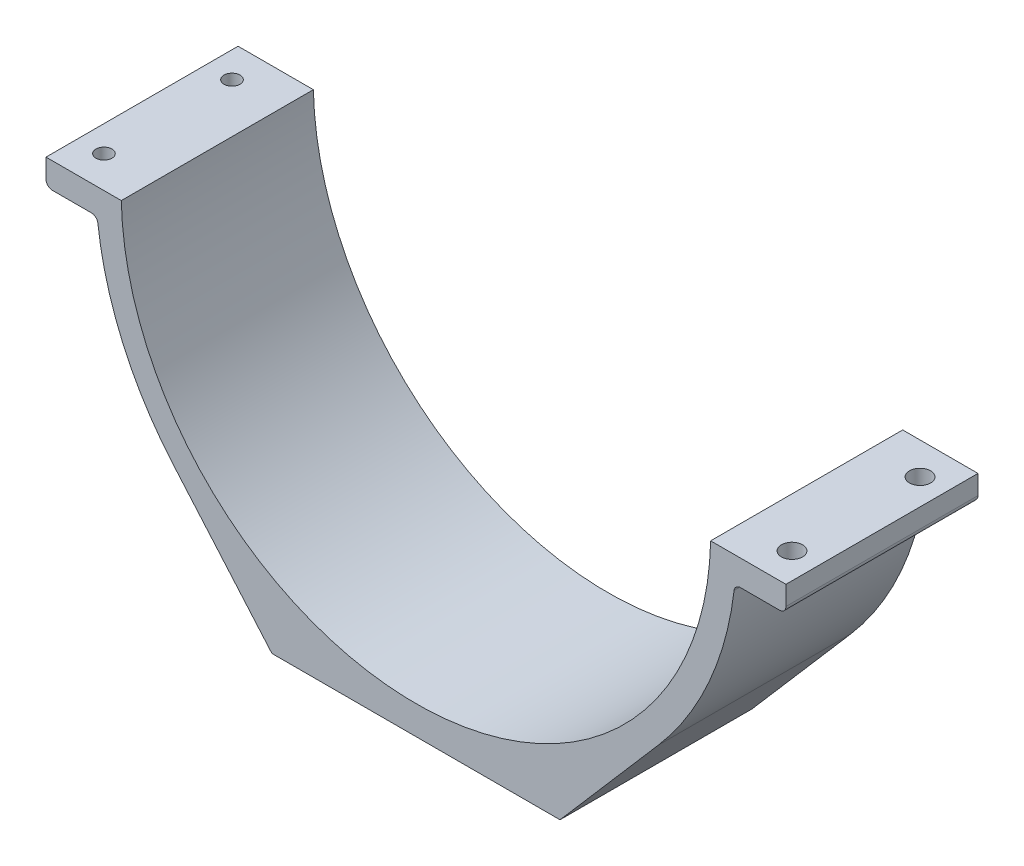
ISO-10303-21;
HEADER;
FILE_DESCRIPTION(('STEP AP214'),'2;1');
FILE_NAME('part.step','',(''),(''),'','','');
FILE_SCHEMA(('AUTOMOTIVE_DESIGN { 1 0 10303 214 1 1 1 1 }'));
ENDSEC;
DATA;
#1=APPLICATION_CONTEXT('core data for automotive mechanical design processes');
#2=APPLICATION_PROTOCOL_DEFINITION('international standard','automotive_design',2000,#1);
#3=PRODUCT_CONTEXT('',#1,'mechanical');
#4=PRODUCT('Part','Part','',(#3));
#5=PRODUCT_RELATED_PRODUCT_CATEGORY('part','',(#4));
#6=PRODUCT_DEFINITION_FORMATION('','',#4);
#7=PRODUCT_DEFINITION_CONTEXT('part definition',#1,'design');
#8=PRODUCT_DEFINITION('design','',#6,#7);
#9=PRODUCT_DEFINITION_SHAPE('','',#8);
#10=(LENGTH_UNIT() NAMED_UNIT(*) SI_UNIT(.MILLI.,.METRE.));
#11=(NAMED_UNIT(*) PLANE_ANGLE_UNIT() SI_UNIT($,.RADIAN.));
#12=(NAMED_UNIT(*) SI_UNIT($,.STERADIAN.) SOLID_ANGLE_UNIT());
#13=UNCERTAINTY_MEASURE_WITH_UNIT(LENGTH_MEASURE(1.E-05),#10,'distance_accuracy_value','');
#14=(GEOMETRIC_REPRESENTATION_CONTEXT(3) GLOBAL_UNCERTAINTY_ASSIGNED_CONTEXT((#13)) GLOBAL_UNIT_ASSIGNED_CONTEXT((#10,
#11,#12)) REPRESENTATION_CONTEXT('',''));
#15=CARTESIAN_POINT('',(0.,0.,0.));
#16=DIRECTION('',(0.,0.,1.));
#17=DIRECTION('',(1.,0.,0.));
#18=AXIS2_PLACEMENT_3D('',#15,#16,#17);
#19=CARTESIAN_POINT('',(-57.7870606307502,-1.,30.));
#20=DIRECTION('',(1.,0.,0.));
#21=DIRECTION('',(0.,1.,0.));
#22=AXIS2_PLACEMENT_3D('',#19,#20,#21);
#23=PLANE('',#22);
#24=DIRECTION('',(0.,-1.,0.));
#25=VECTOR('',#24,1.);
#26=CARTESIAN_POINT('',(-57.7870606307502,-1.,0.));
#27=LINE('',#26,#25);
#28=CARTESIAN_POINT('',(-57.7870606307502,-1.,0.));
#29=VERTEX_POINT('',#28);
#30=CARTESIAN_POINT('',(-57.7870606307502,-4.,0.));
#31=VERTEX_POINT('',#30);
#32=EDGE_CURVE('E183',#29,#31,#27,.T.);
#33=ORIENTED_EDGE('',*,*,#32,.T.);
#34=DIRECTION('',(0.,0.,-1.));
#35=VECTOR('',#34,1.);
#36=CARTESIAN_POINT('',(-57.7870606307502,-4.,30.));
#37=LINE('',#36,#35);
#38=CARTESIAN_POINT('',(-57.7870606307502,-4.,30.));
#39=VERTEX_POINT('',#38);
#40=EDGE_CURVE('E11',#39,#31,#37,.T.);
#41=ORIENTED_EDGE('',*,*,#40,.F.);
#42=DIRECTION('',(0.,-1.,0.));
#43=VECTOR('',#42,1.);
#44=CARTESIAN_POINT('',(-57.7870606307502,-1.,30.));
#45=LINE('',#44,#43);
#46=CARTESIAN_POINT('',(-57.7870606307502,-1.,30.));
#47=VERTEX_POINT('',#46);
#48=EDGE_CURVE('E214',#47,#39,#45,.T.);
#49=ORIENTED_EDGE('',*,*,#48,.F.);
#50=DIRECTION('',(0.,0.,-1.));
#51=VECTOR('',#50,1.);
#52=CARTESIAN_POINT('',(-57.7870606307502,-1.,30.));
#53=LINE('',#52,#51);
#54=EDGE_CURVE('E179',#47,#29,#53,.T.);
#55=ORIENTED_EDGE('',*,*,#54,.T.);
#56=EDGE_LOOP('',(#33,#41,#49,#55));
#57=FACE_BOUND('',#56,.T.);
#58=ADVANCED_FACE('F36',(#57),#23,.F.);
#59=CARTESIAN_POINT('',(-56.7870606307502,-4.,30.));
#60=DIRECTION('',(0.,0.,-1.));
#61=DIRECTION('',(-1.,0.,0.));
#62=AXIS2_PLACEMENT_3D('',#59,#60,#61);
#63=CYLINDRICAL_SURFACE('',#62,1.);
#64=CARTESIAN_POINT('',(-56.7870606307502,-4.,0.));
#65=DIRECTION('',(0.,0.,1.));
#66=DIRECTION('',(1.,0.,0.));
#67=AXIS2_PLACEMENT_3D('',#64,#65,#66);
#68=CIRCLE('',#67,1.);
#69=CARTESIAN_POINT('',(-56.7870606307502,-5.,0.));
#70=VERTEX_POINT('',#69);
#71=EDGE_CURVE('E186',#31,#70,#68,.T.);
#72=ORIENTED_EDGE('',*,*,#71,.T.);
#73=DIRECTION('',(0.,0.,-1.));
#74=VECTOR('',#73,1.);
#75=CARTESIAN_POINT('',(-56.7870606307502,-5.,30.));
#76=LINE('',#75,#74);
#77=CARTESIAN_POINT('',(-56.7870606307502,-5.,30.));
#78=VERTEX_POINT('',#77);
#79=EDGE_CURVE('E44',#78,#70,#76,.T.);
#80=ORIENTED_EDGE('',*,*,#79,.F.);
#81=CARTESIAN_POINT('',(-56.7870606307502,-4.,30.));
#82=DIRECTION('',(0.,0.,1.));
#83=DIRECTION('',(1.,0.,0.));
#84=AXIS2_PLACEMENT_3D('',#81,#82,#83);
#85=CIRCLE('',#84,1.);
#86=EDGE_CURVE('E120',#39,#78,#85,.T.);
#87=ORIENTED_EDGE('',*,*,#86,.F.);
#88=ORIENTED_EDGE('',*,*,#40,.T.);
#89=EDGE_LOOP('',(#72,#80,#87,#88));
#90=FACE_BOUND('',#89,.T.);
#91=ADVANCED_FACE('F315',(#90),#63,.T.);
#92=CARTESIAN_POINT('',(-56.7870606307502,-5.,30.));
#93=DIRECTION('',(0.,1.,0.));
#94=DIRECTION('',(0.,0.,1.));
#95=AXIS2_PLACEMENT_3D('',#92,#93,#94);
#96=PLANE('',#95);
#97=CARTESIAN_POINT('',(-53.7353258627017,-5.,5.));
#98=DIRECTION('',(0.,-1.,0.));
#99=DIRECTION('',(0.,0.,-1.));
#100=AXIS2_PLACEMENT_3D('',#97,#98,#99);
#101=CIRCLE('',#100,1.24999999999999);
#102=CARTESIAN_POINT('',(-53.7353258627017,-5.,3.75000000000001));
#103=VERTEX_POINT('',#102);
#104=EDGE_CURVE('E401',#103,#103,#101,.T.);
#105=ORIENTED_EDGE('',*,*,#104,.F.);
#106=EDGE_LOOP('',(#105));
#107=FACE_BOUND('',#106,.T.);
#108=CARTESIAN_POINT('',(-53.7353258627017,-5.,25.));
#109=DIRECTION('',(0.,-1.,0.));
#110=DIRECTION('',(0.,0.,-1.));
#111=AXIS2_PLACEMENT_3D('',#108,#109,#110);
#112=CIRCLE('',#111,1.24999999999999);
#113=CARTESIAN_POINT('',(-53.7353258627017,-5.,23.75));
#114=VERTEX_POINT('',#113);
#115=EDGE_CURVE('E406',#114,#114,#112,.T.);
#116=ORIENTED_EDGE('',*,*,#115,.F.);
#117=EDGE_LOOP('',(#116));
#118=FACE_BOUND('',#117,.T.);
#119=DIRECTION('',(1.,0.,0.));
#120=VECTOR('',#119,1.);
#121=CARTESIAN_POINT('',(-56.7870606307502,-5.,0.));
#122=LINE('',#121,#120);
#123=CARTESIAN_POINT('',(-50.6835910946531,-5.,0.));
#124=VERTEX_POINT('',#123);
#125=EDGE_CURVE('E189',#70,#124,#122,.T.);
#126=ORIENTED_EDGE('',*,*,#125,.T.);
#127=DIRECTION('',(0.,0.,-1.));
#128=VECTOR('',#127,1.);
#129=CARTESIAN_POINT('',(-50.6835910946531,-5.,30.));
#130=LINE('',#129,#128);
#131=CARTESIAN_POINT('',(-50.6835910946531,-5.,30.));
#132=VERTEX_POINT('',#131);
#133=EDGE_CURVE('E245',#132,#124,#130,.T.);
#134=ORIENTED_EDGE('',*,*,#133,.F.);
#135=DIRECTION('',(1.,0.,0.));
#136=VECTOR('',#135,1.);
#137=CARTESIAN_POINT('',(-56.7870606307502,-5.,30.));
#138=LINE('',#137,#136);
#139=EDGE_CURVE('E253',#78,#132,#138,.T.);
#140=ORIENTED_EDGE('',*,*,#139,.F.);
#141=ORIENTED_EDGE('',*,*,#79,.T.);
#142=EDGE_LOOP('',(#126,#134,#140,#141));
#143=FACE_BOUND('',#142,.T.);
#144=ADVANCED_FACE('F251',(#107,#118,#143),#96,.F.);
#145=CARTESIAN_POINT('',(-50.6835910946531,-6.,30.));
#146=DIRECTION('',(0.,0.,-1.));
#147=DIRECTION('',(-1.,0.,0.));
#148=AXIS2_PLACEMENT_3D('',#145,#146,#147);
#149=CYLINDRICAL_SURFACE('',#148,0.999999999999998);
#150=CARTESIAN_POINT('',(-50.6835910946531,-6.,0.));
#151=DIRECTION('',(0.,0.,-1.));
#152=DIRECTION('',(1.,0.,0.));
#153=AXIS2_PLACEMENT_3D('',#150,#151,#152);
#154=CIRCLE('',#153,0.999999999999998);
#155=CARTESIAN_POINT('',(-49.6905253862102,-5.88243938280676,0.));
#156=VERTEX_POINT('',#155);
#157=EDGE_CURVE('E191',#124,#156,#154,.T.);
#158=ORIENTED_EDGE('',*,*,#157,.T.);
#159=DIRECTION('',(0.,0.,-1.));
#160=VECTOR('',#159,1.);
#161=CARTESIAN_POINT('',(-49.6905253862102,-5.88243938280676,30.));
#162=LINE('',#161,#160);
#163=CARTESIAN_POINT('',(-49.6905253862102,-5.88243938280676,30.));
#164=VERTEX_POINT('',#163);
#165=EDGE_CURVE('E242',#164,#156,#162,.T.);
#166=ORIENTED_EDGE('',*,*,#165,.F.);
#167=CARTESIAN_POINT('',(-50.6835910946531,-6.,30.));
#168=DIRECTION('',(0.,0.,-1.));
#169=DIRECTION('',(1.,0.,0.));
#170=AXIS2_PLACEMENT_3D('',#167,#168,#169);
#171=CIRCLE('',#170,0.999999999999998);
#172=EDGE_CURVE('E271',#132,#164,#171,.T.);
#173=ORIENTED_EDGE('',*,*,#172,.F.);
#174=ORIENTED_EDGE('',*,*,#133,.T.);
#175=EDGE_LOOP('',(#158,#166,#173,#174));
#176=FACE_BOUND('',#175,.T.);
#177=ADVANCED_FACE('F262',(#176),#149,.F.);
#178=CARTESIAN_POINT('',(0.,0.,30.));
#179=DIRECTION('',(0.,0.,-1.));
#180=DIRECTION('',(-1.,0.,0.));
#181=AXIS2_PLACEMENT_3D('',#178,#179,#180);
#182=CYLINDRICAL_SURFACE('',#181,50.0375);
#183=CARTESIAN_POINT('',(0.,0.,0.));
#184=DIRECTION('',(0.,0.,1.));
#185=DIRECTION('',(-1.,0.,0.));
#186=AXIS2_PLACEMENT_3D('',#183,#184,#185);
#187=CIRCLE('',#186,50.0375);
#188=CARTESIAN_POINT('',(-37.8678913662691,-32.7074029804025,0.));
#189=VERTEX_POINT('',#188);
#190=EDGE_CURVE('E193',#156,#189,#187,.T.);
#191=ORIENTED_EDGE('',*,*,#190,.T.);
#192=DIRECTION('',(0.,0.,-1.));
#193=VECTOR('',#192,1.);
#194=CARTESIAN_POINT('',(-37.8678913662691,-32.7074029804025,30.));
#195=LINE('',#194,#193);
#196=CARTESIAN_POINT('',(-37.8678913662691,-32.7074029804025,30.));
#197=VERTEX_POINT('',#196);
#198=EDGE_CURVE('E239',#197,#189,#195,.T.);
#199=ORIENTED_EDGE('',*,*,#198,.F.);
#200=CARTESIAN_POINT('',(0.,0.,30.));
#201=DIRECTION('',(0.,0.,1.));
#202=DIRECTION('',(-1.,0.,0.));
#203=AXIS2_PLACEMENT_3D('',#200,#201,#202);
#204=CIRCLE('',#203,50.0375);
#205=EDGE_CURVE('E268',#164,#197,#204,.T.);
#206=ORIENTED_EDGE('',*,*,#205,.F.);
#207=ORIENTED_EDGE('',*,*,#165,.T.);
#208=EDGE_LOOP('',(#191,#199,#206,#207));
#209=FACE_BOUND('',#208,.T.);
#210=ADVANCED_FACE('F266',(#209),#182,.T.);
#211=CARTESIAN_POINT('',(-37.8678913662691,-32.7074029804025,30.));
#212=DIRECTION('',(0.756790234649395,0.653657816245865,0.));
#213=DIRECTION('',(-0.653657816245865,0.756790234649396,0.));
#214=AXIS2_PLACEMENT_3D('',#211,#212,#213);
#215=PLANE('',#214);
#216=DIRECTION('',(0.653657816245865,-0.756790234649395,0.));
#217=VECTOR('',#216,1.);
#218=CARTESIAN_POINT('',(-37.8678913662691,-32.7074029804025,0.));
#219=LINE('',#218,#217);
#220=CARTESIAN_POINT('',(-22.5,-50.4999999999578,0.));
#221=VERTEX_POINT('',#220);
#222=EDGE_CURVE('E195',#189,#221,#219,.T.);
#223=ORIENTED_EDGE('',*,*,#222,.T.);
#224=DIRECTION('',(0.,0.,-1.));
#225=VECTOR('',#224,1.);
#226=CARTESIAN_POINT('',(-22.5,-50.4999999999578,30.));
#227=LINE('',#226,#225);
#228=CARTESIAN_POINT('',(-22.5,-50.4999999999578,30.));
#229=VERTEX_POINT('',#228);
#230=EDGE_CURVE('E236',#229,#221,#227,.T.);
#231=ORIENTED_EDGE('',*,*,#230,.F.);
#232=DIRECTION('',(0.653657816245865,-0.756790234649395,0.));
#233=VECTOR('',#232,1.);
#234=CARTESIAN_POINT('',(-37.8678913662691,-32.7074029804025,30.));
#235=LINE('',#234,#233);
#236=EDGE_CURVE('E270',#197,#229,#235,.T.);
#237=ORIENTED_EDGE('',*,*,#236,.F.);
#238=ORIENTED_EDGE('',*,*,#198,.T.);
#239=EDGE_LOOP('',(#223,#231,#237,#238));
#240=FACE_BOUND('',#239,.T.);
#241=ADVANCED_FACE('F329',(#240),#215,.F.);
#242=CARTESIAN_POINT('',(22.5,-50.4999999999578,30.));
#243=DIRECTION('',(0.,1.,0.));
#244=DIRECTION('',(-1.,0.,0.));
#245=AXIS2_PLACEMENT_3D('',#242,#243,#244);
#246=PLANE('',#245);
#247=CARTESIAN_POINT('',(-20.,-50.4999999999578,5.));
#248=DIRECTION('',(0.,-1.,0.));
#249=DIRECTION('',(0.,0.,-1.));
#250=AXIS2_PLACEMENT_3D('',#247,#248,#249);
#251=CIRCLE('',#250,1.65);
#252=CARTESIAN_POINT('',(-20.,-50.4999999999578,3.35));
#253=VERTEX_POINT('',#252);
#254=EDGE_CURVE('E369',#253,#253,#251,.T.);
#255=ORIENTED_EDGE('',*,*,#254,.F.);
#256=EDGE_LOOP('',(#255));
#257=FACE_BOUND('',#256,.T.);
#258=CARTESIAN_POINT('',(20.,-50.4999999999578,5.));
#259=DIRECTION('',(0.,-1.,0.));
#260=DIRECTION('',(0.,0.,-1.));
#261=AXIS2_PLACEMENT_3D('',#258,#259,#260);
#262=CIRCLE('',#261,1.65);
#263=CARTESIAN_POINT('',(20.,-50.4999999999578,3.35));
#264=VERTEX_POINT('',#263);
#265=EDGE_CURVE('E383',#264,#264,#262,.T.);
#266=ORIENTED_EDGE('',*,*,#265,.F.);
#267=EDGE_LOOP('',(#266));
#268=FACE_BOUND('',#267,.T.);
#269=CARTESIAN_POINT('',(-20.0000000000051,-50.4999999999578,25.));
#270=DIRECTION('',(0.,-1.,0.));
#271=DIRECTION('',(0.,0.,-1.));
#272=AXIS2_PLACEMENT_3D('',#269,#270,#271);
#273=CIRCLE('',#272,1.65);
#274=CARTESIAN_POINT('',(-20.0000000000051,-50.4999999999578,23.35));
#275=VERTEX_POINT('',#274);
#276=EDGE_CURVE('E389',#275,#275,#273,.T.);
#277=ORIENTED_EDGE('',*,*,#276,.F.);
#278=EDGE_LOOP('',(#277));
#279=FACE_BOUND('',#278,.T.);
#280=CARTESIAN_POINT('',(20.0000000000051,-50.4999999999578,25.));
#281=DIRECTION('',(0.,-1.,0.));
#282=DIRECTION('',(0.,0.,-1.));
#283=AXIS2_PLACEMENT_3D('',#280,#281,#282);
#284=CIRCLE('',#283,1.65);
#285=CARTESIAN_POINT('',(20.0000000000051,-50.4999999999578,23.35));
#286=VERTEX_POINT('',#285);
#287=EDGE_CURVE('E395',#286,#286,#284,.T.);
#288=ORIENTED_EDGE('',*,*,#287,.F.);
#289=EDGE_LOOP('',(#288));
#290=FACE_BOUND('',#289,.T.);
#291=DIRECTION('',(1.,0.,0.));
#292=VECTOR('',#291,1.);
#293=CARTESIAN_POINT('',(22.5,-50.4999999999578,0.));
#294=LINE('',#293,#292);
#295=CARTESIAN_POINT('',(22.5,-50.4999999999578,0.));
#296=VERTEX_POINT('',#295);
#297=EDGE_CURVE('E197',#221,#296,#294,.T.);
#298=ORIENTED_EDGE('',*,*,#297,.T.);
#299=DIRECTION('',(0.,0.,-1.));
#300=VECTOR('',#299,1.);
#301=CARTESIAN_POINT('',(22.5,-50.4999999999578,30.));
#302=LINE('',#301,#300);
#303=CARTESIAN_POINT('',(22.5,-50.4999999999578,30.));
#304=VERTEX_POINT('',#303);
#305=EDGE_CURVE('E233',#304,#296,#302,.T.);
#306=ORIENTED_EDGE('',*,*,#305,.F.);
#307=DIRECTION('',(1.,0.,0.));
#308=VECTOR('',#307,1.);
#309=CARTESIAN_POINT('',(22.5,-50.4999999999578,30.));
#310=LINE('',#309,#308);
#311=EDGE_CURVE('E273',#229,#304,#310,.T.);
#312=ORIENTED_EDGE('',*,*,#311,.F.);
#313=ORIENTED_EDGE('',*,*,#230,.T.);
#314=EDGE_LOOP('',(#298,#306,#312,#313));
#315=FACE_BOUND('',#314,.T.);
#316=ADVANCED_FACE('F332',(#257,#268,#279,#290,#315),#246,.F.);
#317=CARTESIAN_POINT('',(37.8678913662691,-32.7074029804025,30.));
#318=DIRECTION('',(-0.756790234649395,0.653657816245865,0.));
#319=DIRECTION('',(-0.653657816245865,-0.756790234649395,0.));
#320=AXIS2_PLACEMENT_3D('',#317,#318,#319);
#321=PLANE('',#320);
#322=DIRECTION('',(0.653657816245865,0.756790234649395,0.));
#323=VECTOR('',#322,1.);
#324=CARTESIAN_POINT('',(37.8678913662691,-32.7074029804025,0.));
#325=LINE('',#324,#323);
#326=CARTESIAN_POINT('',(37.8678913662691,-32.7074029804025,0.));
#327=VERTEX_POINT('',#326);
#328=EDGE_CURVE('E199',#296,#327,#325,.T.);
#329=ORIENTED_EDGE('',*,*,#328,.T.);
#330=DIRECTION('',(0.,0.,-1.));
#331=VECTOR('',#330,1.);
#332=CARTESIAN_POINT('',(37.8678913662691,-32.7074029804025,30.));
#333=LINE('',#332,#331);
#334=CARTESIAN_POINT('',(37.8678913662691,-32.7074029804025,30.));
#335=VERTEX_POINT('',#334);
#336=EDGE_CURVE('E230',#335,#327,#333,.T.);
#337=ORIENTED_EDGE('',*,*,#336,.F.);
#338=DIRECTION('',(0.653657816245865,0.756790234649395,0.));
#339=VECTOR('',#338,1.);
#340=CARTESIAN_POINT('',(37.8678913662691,-32.7074029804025,30.));
#341=LINE('',#340,#339);
#342=EDGE_CURVE('E279',#304,#335,#341,.T.);
#343=ORIENTED_EDGE('',*,*,#342,.F.);
#344=ORIENTED_EDGE('',*,*,#305,.T.);
#345=EDGE_LOOP('',(#329,#337,#343,#344));
#346=FACE_BOUND('',#345,.T.);
#347=ADVANCED_FACE('F336',(#346),#321,.F.);
#348=CARTESIAN_POINT('',(0.,0.,30.));
#349=DIRECTION('',(0.,0.,-1.));
#350=DIRECTION('',(-1.,0.,0.));
#351=AXIS2_PLACEMENT_3D('',#348,#349,#350);
#352=CYLINDRICAL_SURFACE('',#351,50.0375);
#353=CARTESIAN_POINT('',(0.,0.,0.));
#354=DIRECTION('',(0.,0.,1.));
#355=DIRECTION('',(1.,0.,0.));
#356=AXIS2_PLACEMENT_3D('',#353,#354,#355);
#357=CIRCLE('',#356,50.0375);
#358=CARTESIAN_POINT('',(49.6905253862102,-5.88243938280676,0.));
#359=VERTEX_POINT('',#358);
#360=EDGE_CURVE('E201',#327,#359,#357,.T.);
#361=ORIENTED_EDGE('',*,*,#360,.T.);
#362=DIRECTION('',(0.,0.,-1.));
#363=VECTOR('',#362,1.);
#364=CARTESIAN_POINT('',(49.6905253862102,-5.88243938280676,30.));
#365=LINE('',#364,#363);
#366=CARTESIAN_POINT('',(49.6905253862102,-5.88243938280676,30.));
#367=VERTEX_POINT('',#366);
#368=EDGE_CURVE('E227',#367,#359,#365,.T.);
#369=ORIENTED_EDGE('',*,*,#368,.F.);
#370=CARTESIAN_POINT('',(0.,0.,30.));
#371=DIRECTION('',(0.,0.,1.));
#372=DIRECTION('',(1.,0.,0.));
#373=AXIS2_PLACEMENT_3D('',#370,#371,#372);
#374=CIRCLE('',#373,50.0375);
#375=EDGE_CURVE('E281',#335,#367,#374,.T.);
#376=ORIENTED_EDGE('',*,*,#375,.F.);
#377=ORIENTED_EDGE('',*,*,#336,.T.);
#378=EDGE_LOOP('',(#361,#369,#376,#377));
#379=FACE_BOUND('',#378,.T.);
#380=ADVANCED_FACE('F340',(#379),#352,.T.);
#381=CARTESIAN_POINT('',(50.6835910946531,-6.,30.));
#382=DIRECTION('',(0.,0.,-1.));
#383=DIRECTION('',(-1.,0.,0.));
#384=AXIS2_PLACEMENT_3D('',#381,#382,#383);
#385=CYLINDRICAL_SURFACE('',#384,0.999999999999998);
#386=CARTESIAN_POINT('',(50.6835910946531,-6.,0.));
#387=DIRECTION('',(0.,0.,-1.));
#388=DIRECTION('',(-1.,0.,0.));
#389=AXIS2_PLACEMENT_3D('',#386,#387,#388);
#390=CIRCLE('',#389,0.999999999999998);
#391=CARTESIAN_POINT('',(50.6835910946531,-5.,0.));
#392=VERTEX_POINT('',#391);
#393=EDGE_CURVE('E203',#359,#392,#390,.T.);
#394=ORIENTED_EDGE('',*,*,#393,.T.);
#395=DIRECTION('',(0.,0.,-1.));
#396=VECTOR('',#395,1.);
#397=CARTESIAN_POINT('',(50.6835910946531,-5.,30.));
#398=LINE('',#397,#396);
#399=CARTESIAN_POINT('',(50.6835910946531,-5.,30.));
#400=VERTEX_POINT('',#399);
#401=EDGE_CURVE('E224',#400,#392,#398,.T.);
#402=ORIENTED_EDGE('',*,*,#401,.F.);
#403=CARTESIAN_POINT('',(50.6835910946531,-6.,30.));
#404=DIRECTION('',(0.,0.,-1.));
#405=DIRECTION('',(-1.,0.,0.));
#406=AXIS2_PLACEMENT_3D('',#403,#404,#405);
#407=CIRCLE('',#406,0.999999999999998);
#408=EDGE_CURVE('E283',#367,#400,#407,.T.);
#409=ORIENTED_EDGE('',*,*,#408,.F.);
#410=ORIENTED_EDGE('',*,*,#368,.T.);
#411=EDGE_LOOP('',(#394,#402,#409,#410));
#412=FACE_BOUND('',#411,.T.);
#413=ADVANCED_FACE('F344',(#412),#385,.F.);
#414=CARTESIAN_POINT('',(56.7870606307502,-4.99999999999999,30.));
#415=DIRECTION('',(0.,1.,0.));
#416=DIRECTION('',(-1.,0.,0.));
#417=AXIS2_PLACEMENT_3D('',#414,#415,#416);
#418=PLANE('',#417);
#419=CARTESIAN_POINT('',(53.7353258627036,-5.00000000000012,5.));
#420=DIRECTION('',(0.,-1.,0.));
#421=DIRECTION('',(0.,0.,-1.));
#422=AXIS2_PLACEMENT_3D('',#419,#420,#421);
#423=CIRCLE('',#422,1.65);
#424=CARTESIAN_POINT('',(53.7353258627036,-5.00000000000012,3.35));
#425=VERTEX_POINT('',#424);
#426=EDGE_CURVE('E378',#425,#425,#423,.T.);
#427=ORIENTED_EDGE('',*,*,#426,.F.);
#428=EDGE_LOOP('',(#427));
#429=FACE_BOUND('',#428,.T.);
#430=CARTESIAN_POINT('',(53.7353258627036,-5.00000000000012,25.));
#431=DIRECTION('',(0.,-1.,0.));
#432=DIRECTION('',(0.,0.,-1.));
#433=AXIS2_PLACEMENT_3D('',#430,#431,#432);
#434=CIRCLE('',#433,1.65);
#435=CARTESIAN_POINT('',(53.7353258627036,-5.00000000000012,23.35));
#436=VERTEX_POINT('',#435);
#437=EDGE_CURVE('E370',#436,#436,#434,.T.);
#438=ORIENTED_EDGE('',*,*,#437,.F.);
#439=EDGE_LOOP('',(#438));
#440=FACE_BOUND('',#439,.T.);
#441=DIRECTION('',(1.,0.,0.));
#442=VECTOR('',#441,1.);
#443=CARTESIAN_POINT('',(56.7870606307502,-4.99999999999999,0.));
#444=LINE('',#443,#442);
#445=CARTESIAN_POINT('',(56.7870606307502,-4.99999999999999,0.));
#446=VERTEX_POINT('',#445);
#447=EDGE_CURVE('E205',#392,#446,#444,.T.);
#448=ORIENTED_EDGE('',*,*,#447,.T.);
#449=DIRECTION('',(0.,0.,-1.));
#450=VECTOR('',#449,1.);
#451=CARTESIAN_POINT('',(56.7870606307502,-4.99999999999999,30.));
#452=LINE('',#451,#450);
#453=CARTESIAN_POINT('',(56.7870606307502,-4.99999999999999,30.));
#454=VERTEX_POINT('',#453);
#455=EDGE_CURVE('E221',#454,#446,#452,.T.);
#456=ORIENTED_EDGE('',*,*,#455,.F.);
#457=DIRECTION('',(1.,0.,0.));
#458=VECTOR('',#457,1.);
#459=CARTESIAN_POINT('',(56.7870606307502,-4.99999999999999,30.));
#460=LINE('',#459,#458);
#461=EDGE_CURVE('E285',#400,#454,#460,.T.);
#462=ORIENTED_EDGE('',*,*,#461,.F.);
#463=ORIENTED_EDGE('',*,*,#401,.T.);
#464=EDGE_LOOP('',(#448,#456,#462,#463));
#465=FACE_BOUND('',#464,.T.);
#466=ADVANCED_FACE('F348',(#429,#440,#465),#418,.F.);
#467=CARTESIAN_POINT('',(56.7870606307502,-3.99999999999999,30.));
#468=DIRECTION('',(0.,0.,-1.));
#469=DIRECTION('',(-1.,0.,0.));
#470=AXIS2_PLACEMENT_3D('',#467,#468,#469);
#471=CYLINDRICAL_SURFACE('',#470,1.);
#472=CARTESIAN_POINT('',(56.7870606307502,-3.99999999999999,0.));
#473=DIRECTION('',(0.,0.,1.));
#474=DIRECTION('',(-1.,0.,0.));
#475=AXIS2_PLACEMENT_3D('',#472,#473,#474);
#476=CIRCLE('',#475,1.);
#477=CARTESIAN_POINT('',(57.7870606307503,-3.99999999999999,0.));
#478=VERTEX_POINT('',#477);
#479=EDGE_CURVE('E207',#446,#478,#476,.T.);
#480=ORIENTED_EDGE('',*,*,#479,.T.);
#481=DIRECTION('',(0.,0.,-1.));
#482=VECTOR('',#481,1.);
#483=CARTESIAN_POINT('',(57.7870606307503,-3.99999999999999,30.));
#484=LINE('',#483,#482);
#485=CARTESIAN_POINT('',(57.7870606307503,-3.99999999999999,30.));
#486=VERTEX_POINT('',#485);
#487=EDGE_CURVE('E218',#486,#478,#484,.T.);
#488=ORIENTED_EDGE('',*,*,#487,.F.);
#489=CARTESIAN_POINT('',(56.7870606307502,-3.99999999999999,30.));
#490=DIRECTION('',(0.,0.,1.));
#491=DIRECTION('',(-1.,0.,0.));
#492=AXIS2_PLACEMENT_3D('',#489,#490,#491);
#493=CIRCLE('',#492,1.);
#494=EDGE_CURVE('E287',#454,#486,#493,.T.);
#495=ORIENTED_EDGE('',*,*,#494,.F.);
#496=ORIENTED_EDGE('',*,*,#455,.T.);
#497=EDGE_LOOP('',(#480,#488,#495,#496));
#498=FACE_BOUND('',#497,.T.);
#499=ADVANCED_FACE('F293',(#498),#471,.T.);
#500=CARTESIAN_POINT('',(57.7870606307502,-0.999999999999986,30.));
#501=DIRECTION('',(-1.,0.,0.));
#502=DIRECTION('',(0.,-1.,0.));
#503=AXIS2_PLACEMENT_3D('',#500,#501,#502);
#504=PLANE('',#503);
#505=DIRECTION('',(0.,1.,0.));
#506=VECTOR('',#505,1.);
#507=CARTESIAN_POINT('',(57.7870606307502,-0.999999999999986,0.));
#508=LINE('',#507,#506);
#509=CARTESIAN_POINT('',(57.7870606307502,-0.999999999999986,0.));
#510=VERTEX_POINT('',#509);
#511=EDGE_CURVE('E209',#478,#510,#508,.T.);
#512=ORIENTED_EDGE('',*,*,#511,.T.);
#513=DIRECTION('',(0.,0.,-1.));
#514=VECTOR('',#513,1.);
#515=CARTESIAN_POINT('',(57.7870606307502,-0.999999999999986,30.));
#516=LINE('',#515,#514);
#517=CARTESIAN_POINT('',(57.7870606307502,-0.999999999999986,30.));
#518=VERTEX_POINT('',#517);
#519=EDGE_CURVE('E174',#518,#510,#516,.T.);
#520=ORIENTED_EDGE('',*,*,#519,.F.);
#521=DIRECTION('',(0.,1.,0.));
#522=VECTOR('',#521,1.);
#523=CARTESIAN_POINT('',(57.7870606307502,-0.999999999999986,30.));
#524=LINE('',#523,#522);
#525=EDGE_CURVE('E165',#486,#518,#524,.T.);
#526=ORIENTED_EDGE('',*,*,#525,.F.);
#527=ORIENTED_EDGE('',*,*,#487,.T.);
#528=EDGE_LOOP('',(#512,#520,#526,#527));
#529=FACE_BOUND('',#528,.T.);
#530=ADVANCED_FACE('F297',(#529),#504,.F.);
#531=CARTESIAN_POINT('',(57.7870606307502,-0.999999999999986,30.));
#532=DIRECTION('',(0.,-1.,0.));
#533=DIRECTION('',(1.,0.,0.));
#534=AXIS2_PLACEMENT_3D('',#531,#532,#533);
#535=PLANE('',#534);
#536=CARTESIAN_POINT('',(53.7353258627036,-0.999999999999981,5.));
#537=DIRECTION('',(0.,-1.,0.));
#538=DIRECTION('',(0.,0.,-1.));
#539=AXIS2_PLACEMENT_3D('',#536,#537,#538);
#540=CIRCLE('',#539,1.65);
#541=CARTESIAN_POINT('',(53.7353258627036,-0.999999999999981,3.35));
#542=VERTEX_POINT('',#541);
#543=EDGE_CURVE('E364',#542,#542,#540,.T.);
#544=ORIENTED_EDGE('',*,*,#543,.T.);
#545=EDGE_LOOP('',(#544));
#546=FACE_BOUND('',#545,.T.);
#547=CARTESIAN_POINT('',(53.7353258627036,-0.999999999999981,25.));
#548=DIRECTION('',(0.,-1.,0.));
#549=DIRECTION('',(0.,0.,-1.));
#550=AXIS2_PLACEMENT_3D('',#547,#548,#549);
#551=CIRCLE('',#550,1.65);
#552=CARTESIAN_POINT('',(53.7353258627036,-0.999999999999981,23.35));
#553=VERTEX_POINT('',#552);
#554=EDGE_CURVE('E367',#553,#553,#551,.T.);
#555=ORIENTED_EDGE('',*,*,#554,.T.);
#556=EDGE_LOOP('',(#555));
#557=FACE_BOUND('',#556,.T.);
#558=DIRECTION('',(-1.,0.,0.));
#559=VECTOR('',#558,1.);
#560=CARTESIAN_POINT('',(57.7870606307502,-0.999999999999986,0.));
#561=LINE('',#560,#559);
#562=CARTESIAN_POINT('',(46.0266380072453,-0.999999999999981,0.));
#563=VERTEX_POINT('',#562);
#564=EDGE_CURVE('E173',#510,#563,#561,.T.);
#565=ORIENTED_EDGE('',*,*,#564,.T.);
#566=DIRECTION('',(0.,0.,-1.));
#567=VECTOR('',#566,1.);
#568=CARTESIAN_POINT('',(46.0266380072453,-0.999999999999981,30.));
#569=LINE('',#568,#567);
#570=CARTESIAN_POINT('',(46.0266380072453,-0.999999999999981,30.));
#571=VERTEX_POINT('',#570);
#572=EDGE_CURVE('E170',#571,#563,#569,.T.);
#573=ORIENTED_EDGE('',*,*,#572,.F.);
#574=DIRECTION('',(-1.,0.,0.));
#575=VECTOR('',#574,1.);
#576=CARTESIAN_POINT('',(57.7870606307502,-0.999999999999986,30.));
#577=LINE('',#576,#575);
#578=EDGE_CURVE('E159',#518,#571,#577,.T.);
#579=ORIENTED_EDGE('',*,*,#578,.F.);
#580=ORIENTED_EDGE('',*,*,#519,.T.);
#581=EDGE_LOOP('',(#565,#573,#579,#580));
#582=FACE_BOUND('',#581,.T.);
#583=ADVANCED_FACE('F171',(#546,#557,#582),#535,.F.);
#584=CARTESIAN_POINT('',(0.,0.,30.));
#585=DIRECTION('',(0.,0.,-1.));
#586=DIRECTION('',(-1.,0.,0.));
#587=AXIS2_PLACEMENT_3D('',#584,#585,#586);
#588=CYLINDRICAL_SURFACE('',#587,46.0375);
#589=CARTESIAN_POINT('',(0.,0.,0.));
#590=DIRECTION('',(0.,0.,-1.));
#591=DIRECTION('',(1.,0.,0.));
#592=AXIS2_PLACEMENT_3D('',#589,#590,#591);
#593=CIRCLE('',#592,46.0375);
#594=CARTESIAN_POINT('',(-46.0266380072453,-1.,0.));
#595=VERTEX_POINT('',#594);
#596=EDGE_CURVE('E106',#563,#595,#593,.T.);
#597=ORIENTED_EDGE('',*,*,#596,.T.);
#598=DIRECTION('',(0.,0.,-1.));
#599=VECTOR('',#598,1.);
#600=CARTESIAN_POINT('',(-46.0266380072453,-1.,30.));
#601=LINE('',#600,#599);
#602=CARTESIAN_POINT('',(-46.0266380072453,-1.,30.));
#603=VERTEX_POINT('',#602);
#604=EDGE_CURVE('E175',#603,#595,#601,.T.);
#605=ORIENTED_EDGE('',*,*,#604,.F.);
#606=CARTESIAN_POINT('',(0.,0.,30.));
#607=DIRECTION('',(0.,0.,-1.));
#608=DIRECTION('',(1.,0.,0.));
#609=AXIS2_PLACEMENT_3D('',#606,#607,#608);
#610=CIRCLE('',#609,46.0375);
#611=EDGE_CURVE('E163',#571,#603,#610,.T.);
#612=ORIENTED_EDGE('',*,*,#611,.F.);
#613=ORIENTED_EDGE('',*,*,#572,.T.);
#614=EDGE_LOOP('',(#597,#605,#612,#613));
#615=FACE_BOUND('',#614,.T.);
#616=ADVANCED_FACE('F177',(#615),#588,.F.);
#617=CARTESIAN_POINT('',(-57.7870606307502,-1.,30.));
#618=DIRECTION('',(0.,-1.,0.));
#619=DIRECTION('',(0.,0.,-1.));
#620=AXIS2_PLACEMENT_3D('',#617,#618,#619);
#621=PLANE('',#620);
#622=CARTESIAN_POINT('',(-53.7353258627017,-1.,5.));
#623=DIRECTION('',(0.,-1.,0.));
#624=DIRECTION('',(0.,0.,-1.));
#625=AXIS2_PLACEMENT_3D('',#622,#623,#624);
#626=CIRCLE('',#625,1.25);
#627=CARTESIAN_POINT('',(-53.7353258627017,-1.,3.75));
#628=VERTEX_POINT('',#627);
#629=EDGE_CURVE('E404',#628,#628,#626,.T.);
#630=ORIENTED_EDGE('',*,*,#629,.T.);
#631=EDGE_LOOP('',(#630));
#632=FACE_BOUND('',#631,.T.);
#633=CARTESIAN_POINT('',(-53.7353258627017,-1.,25.));
#634=DIRECTION('',(0.,-1.,0.));
#635=DIRECTION('',(0.,0.,-1.));
#636=AXIS2_PLACEMENT_3D('',#633,#634,#635);
#637=CIRCLE('',#636,1.25);
#638=CARTESIAN_POINT('',(-53.7353258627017,-1.,23.75));
#639=VERTEX_POINT('',#638);
#640=EDGE_CURVE('E187',#639,#639,#637,.T.);
#641=ORIENTED_EDGE('',*,*,#640,.T.);
#642=EDGE_LOOP('',(#641));
#643=FACE_BOUND('',#642,.T.);
#644=DIRECTION('',(-1.,0.,0.));
#645=VECTOR('',#644,1.);
#646=CARTESIAN_POINT('',(-57.7870606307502,-1.,0.));
#647=LINE('',#646,#645);
#648=EDGE_CURVE('E112',#595,#29,#647,.T.);
#649=ORIENTED_EDGE('',*,*,#648,.T.);
#650=ORIENTED_EDGE('',*,*,#54,.F.);
#651=DIRECTION('',(-1.,0.,0.));
#652=VECTOR('',#651,1.);
#653=CARTESIAN_POINT('',(-57.7870606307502,-1.,30.));
#654=LINE('',#653,#652);
#655=EDGE_CURVE('E52',#603,#47,#654,.T.);
#656=ORIENTED_EDGE('',*,*,#655,.F.);
#657=ORIENTED_EDGE('',*,*,#604,.T.);
#658=EDGE_LOOP('',(#649,#650,#656,#657));
#659=FACE_BOUND('',#658,.T.);
#660=ADVANCED_FACE('F301',(#632,#643,#659),#621,.F.);
#661=CARTESIAN_POINT('',(-56.7870606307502,-4.,30.));
#662=DIRECTION('',(0.,0.,1.));
#663=DIRECTION('',(1.,0.,0.));
#664=AXIS2_PLACEMENT_3D('',#661,#662,#663);
#665=PLANE('',#664);
#666=ORIENTED_EDGE('',*,*,#48,.T.);
#667=ORIENTED_EDGE('',*,*,#86,.T.);
#668=ORIENTED_EDGE('',*,*,#139,.T.);
#669=ORIENTED_EDGE('',*,*,#172,.T.);
#670=ORIENTED_EDGE('',*,*,#205,.T.);
#671=ORIENTED_EDGE('',*,*,#236,.T.);
#672=ORIENTED_EDGE('',*,*,#311,.T.);
#673=ORIENTED_EDGE('',*,*,#342,.T.);
#674=ORIENTED_EDGE('',*,*,#375,.T.);
#675=ORIENTED_EDGE('',*,*,#408,.T.);
#676=ORIENTED_EDGE('',*,*,#461,.T.);
#677=ORIENTED_EDGE('',*,*,#494,.T.);
#678=ORIENTED_EDGE('',*,*,#525,.T.);
#679=ORIENTED_EDGE('',*,*,#578,.T.);
#680=ORIENTED_EDGE('',*,*,#611,.T.);
#681=ORIENTED_EDGE('',*,*,#655,.T.);
#682=EDGE_LOOP('',(#666,#667,#668,#669,#670,#671,#672,#673,#674,#675,#676,#677,#678,#679,#680,#681));
#683=FACE_BOUND('',#682,.T.);
#684=ADVANCED_FACE('F161',(#683),#665,.T.);
#685=CARTESIAN_POINT('',(-56.7870606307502,-4.,0.));
#686=DIRECTION('',(0.,0.,1.));
#687=DIRECTION('',(1.,0.,0.));
#688=AXIS2_PLACEMENT_3D('',#685,#686,#687);
#689=PLANE('',#688);
#690=ORIENTED_EDGE('',*,*,#32,.F.);
#691=ORIENTED_EDGE('',*,*,#648,.F.);
#692=ORIENTED_EDGE('',*,*,#596,.F.);
#693=ORIENTED_EDGE('',*,*,#564,.F.);
#694=ORIENTED_EDGE('',*,*,#511,.F.);
#695=ORIENTED_EDGE('',*,*,#479,.F.);
#696=ORIENTED_EDGE('',*,*,#447,.F.);
#697=ORIENTED_EDGE('',*,*,#393,.F.);
#698=ORIENTED_EDGE('',*,*,#360,.F.);
#699=ORIENTED_EDGE('',*,*,#328,.F.);
#700=ORIENTED_EDGE('',*,*,#297,.F.);
#701=ORIENTED_EDGE('',*,*,#222,.F.);
#702=ORIENTED_EDGE('',*,*,#190,.F.);
#703=ORIENTED_EDGE('',*,*,#157,.F.);
#704=ORIENTED_EDGE('',*,*,#125,.F.);
#705=ORIENTED_EDGE('',*,*,#71,.F.);
#706=EDGE_LOOP('',(#690,#691,#692,#693,#694,#695,#696,#697,#698,#699,#700,#701,#702,#703,#704,#705));
#707=FACE_BOUND('',#706,.T.);
#708=ADVANCED_FACE('F257',(#707),#689,.F.);
#709=CARTESIAN_POINT('',(-53.7353258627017,-5.,25.));
#710=DIRECTION('',(0.,-1.,0.));
#711=DIRECTION('',(0.,0.,-1.));
#712=AXIS2_PLACEMENT_3D('',#709,#710,#711);
#713=CYLINDRICAL_SURFACE('',#712,1.24999999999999);
#714=ORIENTED_EDGE('',*,*,#640,.F.);
#715=EDGE_LOOP('',(#714));
#716=FACE_BOUND('',#715,.T.);
#717=ORIENTED_EDGE('',*,*,#115,.T.);
#718=EDGE_LOOP('',(#717));
#719=FACE_BOUND('',#718,.T.);
#720=ADVANCED_FACE('F414',(#716,#719),#713,.F.);
#721=CARTESIAN_POINT('',(-53.7353258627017,-5.,5.));
#722=DIRECTION('',(0.,-1.,0.));
#723=DIRECTION('',(0.,0.,-1.));
#724=AXIS2_PLACEMENT_3D('',#721,#722,#723);
#725=CYLINDRICAL_SURFACE('',#724,1.24999999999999);
#726=ORIENTED_EDGE('',*,*,#629,.F.);
#727=EDGE_LOOP('',(#726));
#728=FACE_BOUND('',#727,.T.);
#729=ORIENTED_EDGE('',*,*,#104,.T.);
#730=EDGE_LOOP('',(#729));
#731=FACE_BOUND('',#730,.T.);
#732=ADVANCED_FACE('F417',(#728,#731),#725,.F.);
#733=CARTESIAN_POINT('',(20.0000000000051,-42.9999999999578,25.));
#734=DIRECTION('',(0.,-1.,0.));
#735=DIRECTION('',(0.,0.,-1.));
#736=AXIS2_PLACEMENT_3D('',#733,#734,#735);
#737=CONICAL_SURFACE('',#736,1.65,1.02974425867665);
#738=CARTESIAN_POINT('',(20.0000000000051,-42.0085799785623,25.));
#739=VERTEX_POINT('',#738);
#740=VERTEX_LOOP('',#739);
#741=FACE_BOUND('',#740,.T.);
#742=CARTESIAN_POINT('',(20.0000000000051,-42.9999999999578,25.));
#743=DIRECTION('',(0.,-1.,0.));
#744=DIRECTION('',(0.,0.,-1.));
#745=AXIS2_PLACEMENT_3D('',#742,#743,#744);
#746=CIRCLE('',#745,1.65);
#747=CARTESIAN_POINT('',(20.0000000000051,-42.9999999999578,23.35));
#748=VERTEX_POINT('',#747);
#749=EDGE_CURVE('E398',#748,#748,#746,.T.);
#750=ORIENTED_EDGE('',*,*,#749,.T.);
#751=EDGE_LOOP('',(#750));
#752=FACE_BOUND('',#751,.T.);
#753=ADVANCED_FACE('F425',(#741,#752),#737,.F.);
#754=CARTESIAN_POINT('',(20.0000000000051,-50.4999999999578,25.));
#755=DIRECTION('',(0.,-1.,0.));
#756=DIRECTION('',(0.,0.,-1.));
#757=AXIS2_PLACEMENT_3D('',#754,#755,#756);
#758=CYLINDRICAL_SURFACE('',#757,1.65);
#759=ORIENTED_EDGE('',*,*,#749,.F.);
#760=EDGE_LOOP('',(#759));
#761=FACE_BOUND('',#760,.T.);
#762=ORIENTED_EDGE('',*,*,#287,.T.);
#763=EDGE_LOOP('',(#762));
#764=FACE_BOUND('',#763,.T.);
#765=ADVANCED_FACE('F431',(#761,#764),#758,.F.);
#766=CARTESIAN_POINT('',(-20.0000000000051,-42.9999999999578,25.));
#767=DIRECTION('',(0.,-1.,0.));
#768=DIRECTION('',(0.,0.,-1.));
#769=AXIS2_PLACEMENT_3D('',#766,#767,#768);
#770=CONICAL_SURFACE('',#769,1.65,1.02974425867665);
#771=CARTESIAN_POINT('',(-20.0000000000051,-42.0085799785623,25.));
#772=VERTEX_POINT('',#771);
#773=VERTEX_LOOP('',#772);
#774=FACE_BOUND('',#773,.T.);
#775=CARTESIAN_POINT('',(-20.0000000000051,-42.9999999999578,25.));
#776=DIRECTION('',(0.,-1.,0.));
#777=DIRECTION('',(0.,0.,-1.));
#778=AXIS2_PLACEMENT_3D('',#775,#776,#777);
#779=CIRCLE('',#778,1.65);
#780=CARTESIAN_POINT('',(-20.0000000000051,-42.9999999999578,23.35));
#781=VERTEX_POINT('',#780);
#782=EDGE_CURVE('E392',#781,#781,#779,.T.);
#783=ORIENTED_EDGE('',*,*,#782,.T.);
#784=EDGE_LOOP('',(#783));
#785=FACE_BOUND('',#784,.T.);
#786=ADVANCED_FACE('F435',(#774,#785),#770,.F.);
#787=CARTESIAN_POINT('',(-20.0000000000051,-50.4999999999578,25.));
#788=DIRECTION('',(0.,-1.,0.));
#789=DIRECTION('',(0.,0.,-1.));
#790=AXIS2_PLACEMENT_3D('',#787,#788,#789);
#791=CYLINDRICAL_SURFACE('',#790,1.65);
#792=ORIENTED_EDGE('',*,*,#782,.F.);
#793=EDGE_LOOP('',(#792));
#794=FACE_BOUND('',#793,.T.);
#795=ORIENTED_EDGE('',*,*,#276,.T.);
#796=EDGE_LOOP('',(#795));
#797=FACE_BOUND('',#796,.T.);
#798=ADVANCED_FACE('F439',(#794,#797),#791,.F.);
#799=CARTESIAN_POINT('',(20.,-42.9999999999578,5.));
#800=DIRECTION('',(0.,-1.,0.));
#801=DIRECTION('',(0.,0.,-1.));
#802=AXIS2_PLACEMENT_3D('',#799,#800,#801);
#803=CONICAL_SURFACE('',#802,1.65,1.02974425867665);
#804=CARTESIAN_POINT('',(20.,-42.0085799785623,5.));
#805=VERTEX_POINT('',#804);
#806=VERTEX_LOOP('',#805);
#807=FACE_BOUND('',#806,.T.);
#808=CARTESIAN_POINT('',(20.,-42.9999999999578,5.));
#809=DIRECTION('',(0.,-1.,0.));
#810=DIRECTION('',(0.,0.,-1.));
#811=AXIS2_PLACEMENT_3D('',#808,#809,#810);
#812=CIRCLE('',#811,1.65);
#813=CARTESIAN_POINT('',(20.,-42.9999999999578,3.35));
#814=VERTEX_POINT('',#813);
#815=EDGE_CURVE('E386',#814,#814,#812,.T.);
#816=ORIENTED_EDGE('',*,*,#815,.T.);
#817=EDGE_LOOP('',(#816));
#818=FACE_BOUND('',#817,.T.);
#819=ADVANCED_FACE('F443',(#807,#818),#803,.F.);
#820=CARTESIAN_POINT('',(20.,-50.4999999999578,5.));
#821=DIRECTION('',(0.,-1.,0.));
#822=DIRECTION('',(0.,0.,-1.));
#823=AXIS2_PLACEMENT_3D('',#820,#821,#822);
#824=CYLINDRICAL_SURFACE('',#823,1.65);
#825=ORIENTED_EDGE('',*,*,#815,.F.);
#826=EDGE_LOOP('',(#825));
#827=FACE_BOUND('',#826,.T.);
#828=ORIENTED_EDGE('',*,*,#265,.T.);
#829=EDGE_LOOP('',(#828));
#830=FACE_BOUND('',#829,.T.);
#831=ADVANCED_FACE('F447',(#827,#830),#824,.F.);
#832=CARTESIAN_POINT('',(-20.,-42.9999999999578,5.));
#833=DIRECTION('',(0.,-1.,0.));
#834=DIRECTION('',(0.,0.,-1.));
#835=AXIS2_PLACEMENT_3D('',#832,#833,#834);
#836=CONICAL_SURFACE('',#835,1.65,1.02974425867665);
#837=CARTESIAN_POINT('',(-20.,-42.0085799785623,5.));
#838=VERTEX_POINT('',#837);
#839=VERTEX_LOOP('',#838);
#840=FACE_BOUND('',#839,.T.);
#841=CARTESIAN_POINT('',(-20.,-42.9999999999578,5.));
#842=DIRECTION('',(0.,-1.,0.));
#843=DIRECTION('',(0.,0.,-1.));
#844=AXIS2_PLACEMENT_3D('',#841,#842,#843);
#845=CIRCLE('',#844,1.65);
#846=CARTESIAN_POINT('',(-20.,-42.9999999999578,3.35));
#847=VERTEX_POINT('',#846);
#848=EDGE_CURVE('E373',#847,#847,#845,.T.);
#849=ORIENTED_EDGE('',*,*,#848,.T.);
#850=EDGE_LOOP('',(#849));
#851=FACE_BOUND('',#850,.T.);
#852=ADVANCED_FACE('F451',(#840,#851),#836,.F.);
#853=CARTESIAN_POINT('',(-20.,-50.4999999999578,5.));
#854=DIRECTION('',(0.,-1.,0.));
#855=DIRECTION('',(0.,0.,-1.));
#856=AXIS2_PLACEMENT_3D('',#853,#854,#855);
#857=CYLINDRICAL_SURFACE('',#856,1.65);
#858=ORIENTED_EDGE('',*,*,#848,.F.);
#859=EDGE_LOOP('',(#858));
#860=FACE_BOUND('',#859,.T.);
#861=ORIENTED_EDGE('',*,*,#254,.T.);
#862=EDGE_LOOP('',(#861));
#863=FACE_BOUND('',#862,.T.);
#864=ADVANCED_FACE('F455',(#860,#863),#857,.F.);
#865=CARTESIAN_POINT('',(53.7353258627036,-0.999999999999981,25.));
#866=DIRECTION('',(0.,-1.,0.));
#867=DIRECTION('',(0.,0.,-1.));
#868=AXIS2_PLACEMENT_3D('',#865,#866,#867);
#869=CYLINDRICAL_SURFACE('',#868,1.65);
#870=ORIENTED_EDGE('',*,*,#554,.F.);
#871=EDGE_LOOP('',(#870));
#872=FACE_BOUND('',#871,.T.);
#873=ORIENTED_EDGE('',*,*,#437,.T.);
#874=EDGE_LOOP('',(#873));
#875=FACE_BOUND('',#874,.T.);
#876=ADVANCED_FACE('F459',(#872,#875),#869,.F.);
#877=CARTESIAN_POINT('',(53.7353258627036,-0.999999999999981,5.));
#878=DIRECTION('',(0.,-1.,0.));
#879=DIRECTION('',(0.,0.,-1.));
#880=AXIS2_PLACEMENT_3D('',#877,#878,#879);
#881=CYLINDRICAL_SURFACE('',#880,1.65);
#882=ORIENTED_EDGE('',*,*,#543,.F.);
#883=EDGE_LOOP('',(#882));
#884=FACE_BOUND('',#883,.T.);
#885=ORIENTED_EDGE('',*,*,#426,.T.);
#886=EDGE_LOOP('',(#885));
#887=FACE_BOUND('',#886,.T.);
#888=ADVANCED_FACE('F463',(#884,#887),#881,.F.);
#889=CLOSED_SHELL('',(#58,#91,#144,#177,#210,#241,#316,#347,#380,#413,#466,#499,#530,#583,#616,
#660,#684,#708,#720,#732,#753,#765,#786,#798,#819,#831,#852,#864,#876,#888));
#890=MANIFOLD_SOLID_BREP('B2',#889);
#891=ADVANCED_BREP_SHAPE_REPRESENTATION('',(#18,#890),#14);
#892=SHAPE_DEFINITION_REPRESENTATION(#9,#891);
ENDSEC;
END-ISO-10303-21;
